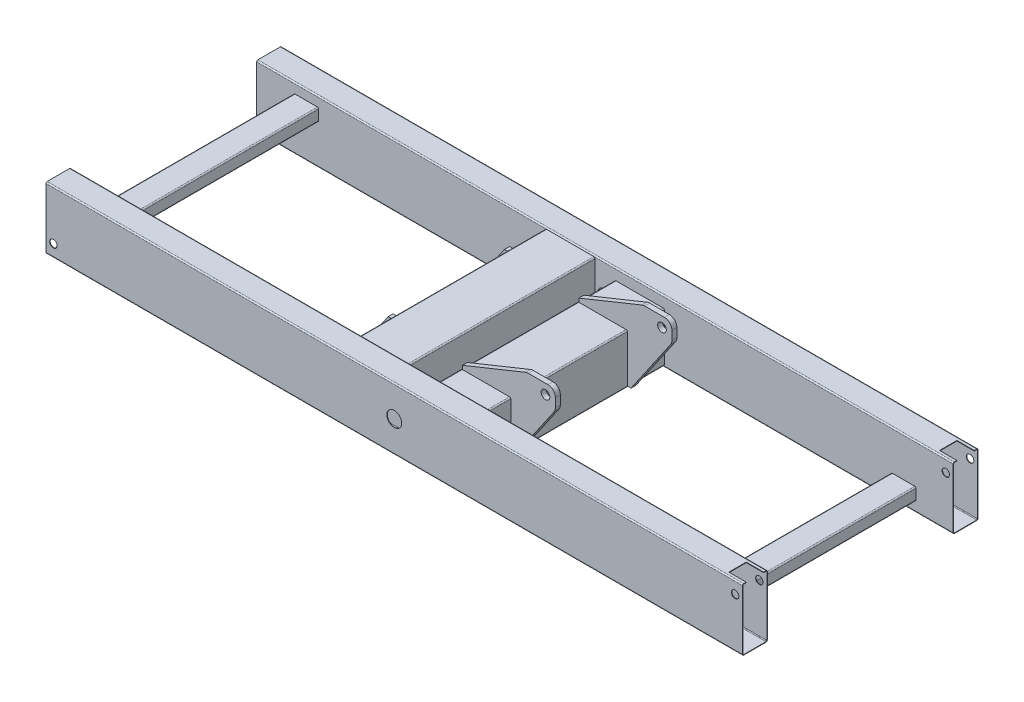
from build123d import *

# Parameters (mm, degrees)
C_250X100X2_1_DEPTH   = 2810
C_250X100X2_1_2_DEPTH = 2810
BOSS_EXTRUDE1_REACH   = 1648.861
BOSS_EXTRUDE2_REACH   = 1648.861
SKETCH14_R            = 15
SKETCH14_R_2          = 30
CUT_EXTRUDE1_DEPTH    = 1701.632235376
SKETCH15_W            = 70
SKETCH15_H            = 70
CUT_EXTRUDE2_DEPTH    = 10
SKETCH16_R            = 17.5
BOSS_EXTRUDE3_DEPTH   = 245
BOSS_EXTRUDE3_2_DEPTH = 245
SKETCH16_2_R          = 17.5
CUT_EXTRUDE3_DEPTH    = 225


with BuildPart() as part:
    # Sketch11 → C 250X100X2_1 (new body)
    with BuildSketch(Plane(origin=(-1405, 0, -425), x_dir=(0, 1, 0), z_dir=(1, 0, 0))):
        with BuildLine():
            Line((-120, 50), (120, 50))
            ThreePointArc((120, 50), (123.535533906, 48.535533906), (125, 45))
            Line((125, 45), (125, -45))
            ThreePointArc((125, -45), (123.535533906, -48.535533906), (120, -50))
            Line((120, -50), (-120, -50))
            ThreePointArc((-120, -50), (-123.535533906, -48.535533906), (-125, -45))
            Line((-125, -45), (-125, 45))
            ThreePointArc((-125, 45), (-123.535533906, 48.535533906), (-120, 50))
        make_face()
        with BuildLine():
            Line((-123, 45), (-123, -45))
            ThreePointArc((-123, -45), (-122.121320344, -47.121320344), (-120, -48))
            Line((-120, -48), (120, -48))
            ThreePointArc((120, -48), (122.121320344, -47.121320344), (123, -45))
            Line((123, -45), (123, 45))
            ThreePointArc((123, 45), (122.121320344, 47.121320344), (120, 48))
            Line((120, 48), (-120, 48))
            ThreePointArc((-120, 48), (-122.121320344, 47.121320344), (-123, 45))
        make_face(mode=Mode.SUBTRACT)
    extrude(amount=C_250X100X2_1_DEPTH)


with BuildPart() as body_2:
    # Sketch11 on segment 2 (on carried to segment 2) → C 250X100X2_1 2 (new body)
    with BuildSketch(Plane(origin=(-1405, 0, 425), x_dir=(0, 1, 0), z_dir=(1, 0, 0))):
        with BuildLine():
            Line((-120, 50), (120, 50))
            ThreePointArc((120, 50), (123.535533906, 48.535533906), (125, 45))
            Line((125, 45), (125, -45))
            ThreePointArc((125, -45), (123.535533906, -48.535533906), (120, -50))
            Line((120, -50), (-120, -50))
            ThreePointArc((-120, -50), (-123.535533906, -48.535533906), (-125, -45))
            Line((-125, -45), (-125, 45))
            ThreePointArc((-125, 45), (-123.535533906, 48.535533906), (-120, 50))
        make_face()
        with BuildLine():
            Line((-123, 45), (-123, -45))
            ThreePointArc((-123, -45), (-122.121320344, -47.121320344), (-120, -48))
            Line((-120, -48), (120, -48))
            ThreePointArc((120, -48), (122.121320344, -47.121320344), (123, -45))
            Line((123, -45), (123, 45))
            ThreePointArc((123, 45), (122.121320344, 47.121320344), (120, 48))
            Line((120, 48), (-120, 48))
            ThreePointArc((-120, 48), (-122.121320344, 47.121320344), (-123, 45))
        make_face(mode=Mode.SUBTRACT)
    extrude(amount=C_250X100X2_1_2_DEPTH)


with BuildPart() as body_3:

    # Sketch12 → Boss-Extrude1 (new, up to next)
    with BuildSketch(Plane.XY.offset(-375), mode=Mode.PRIVATE) as boss_extrude1_sk1:
        with BuildLine():
            Line((1160, -35), (1250, -35))
            ThreePointArc((1250, -35), (1253.535533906, -36.464466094), (1255, -40))
            Line((1255, -40), (1255, -80))
            ThreePointArc((1255, -80), (1253.535533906, -83.535533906), (1250, -85))
            Line((1250, -85), (1160, -85))
            ThreePointArc((1160, -85), (1156.464466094, -83.535533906), (1155, -80))
            Line((1155, -80), (1155, -40))
            ThreePointArc((1155, -40), (1156.464466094, -36.464466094), (1160, -35))
        make_face()
        with BuildLine():
            Line((1157, -40), (1157, -80))
            ThreePointArc((1157, -80), (1157.878679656, -82.121320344), (1160, -83))
            Line((1160, -83), (1250, -83))
            ThreePointArc((1250, -83), (1252.121320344, -82.121320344), (1253, -80))
            Line((1253, -80), (1253, -40))
            ThreePointArc((1253, -40), (1252.121320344, -37.878679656), (1250, -37))
            Line((1250, -37), (1160, -37))
            ThreePointArc((1160, -37), (1157.878679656, -37.878679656), (1157, -40))
        make_face(mode=Mode.SUBTRACT)
    boss_extrude1_tool1 = extrude(boss_extrude1_sk1.sketch, amount=BOSS_EXTRUDE1_REACH, mode=Mode.PRIVATE) - body_2.part
    # Sketch12 → Boss-Extrude1 (new, up to next)
    with BuildSketch(Plane.XY.offset(-375), mode=Mode.PRIVATE) as boss_extrude1_sk2:
        with BuildLine():
            Line((-1160, 35), (-1250, 35))
            ThreePointArc((-1250, 35), (-1253.535533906, 36.464466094), (-1255, 40))
            Line((-1255, 40), (-1255, 80))
            ThreePointArc((-1255, 80), (-1253.535533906, 83.535533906), (-1250, 85))
            Line((-1250, 85), (-1160, 85))
            ThreePointArc((-1160, 85), (-1156.464466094, 83.535533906), (-1155, 80))
            Line((-1155, 80), (-1155, 40))
            ThreePointArc((-1155, 40), (-1156.464466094, 36.464466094), (-1160, 35))
        make_face()
        with BuildLine():
            Line((-1157, 40), (-1157, 80))
            ThreePointArc((-1157, 80), (-1157.878679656, 82.121320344), (-1160, 83))
            Line((-1160, 83), (-1250, 83))
            ThreePointArc((-1250, 83), (-1252.121320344, 82.121320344), (-1253, 80))
            Line((-1253, 80), (-1253, 40))
            ThreePointArc((-1253, 40), (-1252.121320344, 37.878679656), (-1250, 37))
            Line((-1250, 37), (-1160, 37))
            ThreePointArc((-1160, 37), (-1157.878679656, 37.878679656), (-1157, 40))
        make_face(mode=Mode.SUBTRACT)
    boss_extrude1_tool2 = extrude(boss_extrude1_sk2.sketch, amount=BOSS_EXTRUDE1_REACH, mode=Mode.PRIVATE) - body_2.part
    add(boss_extrude1_tool1.solids().sort_by_distance((1205, -36.118034, -375))[0])
    add(boss_extrude1_tool2.solids().sort_by_distance((-1205, 36.118034, -375))[0])


with BuildPart() as body_4:

    # Sketch13 → Boss-Extrude2 (new, up to next)
    with BuildSketch(Plane.XY.offset(-375), mode=Mode.PRIVATE) as boss_extrude2_sk1:
        with BuildLine():
            Line((45, 80), (235, 80))
            ThreePointArc((235, 80), (238.535533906, 78.535533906), (240, 75))
            Line((240, 75), (240, -115))
            ThreePointArc((240, -115), (238.535533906, -118.535533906), (235, -120))
            Line((235, -120), (45, -120))
            ThreePointArc((45, -120), (41.464466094, -118.535533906), (40, -115))
            Line((40, -115), (40, 75))
            ThreePointArc((40, 75), (41.464466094, 78.535533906), (45, 80))
        make_face()
        with BuildLine():
            Line((42, 75), (42, -115))
            ThreePointArc((42, -115), (42.878679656, -117.121320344), (45, -118))
            Line((45, -118), (235, -118))
            ThreePointArc((235, -118), (237.121320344, -117.121320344), (238, -115))
            Line((238, -115), (238, 75))
            ThreePointArc((238, 75), (237.121320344, 77.121320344), (235, 78))
            Line((235, 78), (45, 78))
            ThreePointArc((45, 78), (42.878679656, 77.121320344), (42, 75))
        make_face(mode=Mode.SUBTRACT)
    boss_extrude2_tool1 = extrude(boss_extrude2_sk1.sketch, amount=BOSS_EXTRUDE2_REACH, mode=Mode.PRIVATE) - body_2.part
    # Sketch13 → Boss-Extrude2 (new, up to next)
    with BuildSketch(Plane.XY.offset(-375), mode=Mode.PRIVATE) as boss_extrude2_sk2:
        with BuildLine():
            Line((-45, -80), (-235, -80))
            ThreePointArc((-235, -80), (-238.535533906, -78.535533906), (-240, -75))
            Line((-240, -75), (-240, 115))
            ThreePointArc((-240, 115), (-238.535533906, 118.535533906), (-235, 120))
            Line((-235, 120), (-45, 120))
            ThreePointArc((-45, 120), (-41.464466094, 118.535533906), (-40, 115))
            Line((-40, 115), (-40, -75))
            ThreePointArc((-40, -75), (-41.464466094, -78.535533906), (-45, -80))
        make_face()
        with BuildLine():
            Line((-42, -75), (-42, 115))
            ThreePointArc((-42, 115), (-42.878679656, 117.121320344), (-45, 118))
            Line((-45, 118), (-235, 118))
            ThreePointArc((-235, 118), (-237.121320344, 117.121320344), (-238, 115))
            Line((-238, 115), (-238, -75))
            ThreePointArc((-238, -75), (-237.121320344, -77.121320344), (-235, -78))
            Line((-235, -78), (-45, -78))
            ThreePointArc((-45, -78), (-42.878679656, -77.121320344), (-42, -75))
        make_face(mode=Mode.SUBTRACT)
    boss_extrude2_tool2 = extrude(boss_extrude2_sk2.sketch, amount=BOSS_EXTRUDE2_REACH, mode=Mode.PRIVATE) - body_2.part
    add(boss_extrude2_tool1.solids().sort_by_distance((140, 79.717157, -375))[0])
    add(boss_extrude2_tool2.solids().sort_by_distance((-40.282843, 20, -375))[0])


with BuildPart() as cut_extrude1_tool:
    # Sketch14 → Cut-Extrude1 (new, through all)
    with BuildSketch(Plane.XY.offset(475)):
        with Locations(Location((1375, 75, 0), (0, 0, 270))):
            Circle(SKETCH14_R)
        with Locations(Location((-1375, -75, 0), (0, 0, 270))):
            Circle(SKETCH14_R)
        with Locations(Location((0, 0, 0), (0, 0, 270))):
            Circle(SKETCH14_R_2)
    extrude(amount=-CUT_EXTRUDE1_DEPTH)


with BuildPart() as part_1:
    add(part.part)

    # Cut-Extrude1: cut by cut_extrude1_tool
    add(cut_extrude1_tool.part, mode=Mode.SUBTRACT)


with BuildPart() as body_2_1:
    add(body_2.part)

    # Cut-Extrude1: cut by cut_extrude1_tool
    add(cut_extrude1_tool.part, mode=Mode.SUBTRACT)


with BuildPart() as cut_extrude2_tool:
    # Sketch15 → Cut-Extrude2 (new body)
    with BuildSketch(Plane(origin=(0, 125, 0), x_dir=(1, 0, 0), z_dir=(0, 1, 0))):
        with Locations((1370, -425)):
            Rectangle(SKETCH15_W, SKETCH15_H)
        with Locations((1370, 425)):
            Rectangle(SKETCH15_W, SKETCH15_H)
    extrude(amount=-CUT_EXTRUDE2_DEPTH)


with BuildPart() as part_2:
    add(part_1.part)

    # Cut-Extrude2: cut by cut_extrude2_tool
    add(cut_extrude2_tool.part, mode=Mode.SUBTRACT)


with BuildPart() as body_2_2:
    add(body_2_1.part)

    # Cut-Extrude2: cut by cut_extrude2_tool
    add(cut_extrude2_tool.part, mode=Mode.SUBTRACT)


with BuildPart() as body_5:
    # Sketch16 → Boss-Extrude3 (new, symmetric)
    with BuildSketch(Plane.XY):
        with BuildLine():
            Line((45, 80), (235, 80))
            ThreePointArc((235, 80), (238.535533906, 78.535533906), (240, 75))
            Line((240, 75), (240, -115))
            Line((240, -115), (255, -115))
            Line((255, -115), (414.721257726, 117.32182942))
            ThreePointArc((414.721257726, 117.32182942), (418.649936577, 125.419315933), (420, 134.317694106))
            Line((420, 134.317694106), (420, 170))
            ThreePointArc((420, 170), (411.213203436, 191.213203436), (390, 200))
            Line((390, 200), (310.828999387, 200))
            ThreePointArc((310.828999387, 200), (305.107009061, 199.449258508), (299.595107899, 197.817255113))
            Line((299.595107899, 197.817255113), (45, 95))
            Line((45, 95), (45, 80))
        make_face()
        with Locations((380, 160)):
            Circle(SKETCH16_R, mode=Mode.SUBTRACT)
    extrude(amount=BOSS_EXTRUDE3_DEPTH, both=True)


with BuildPart() as body_6:
    # Sketch16 → Boss-Extrude3 2 (new, symmetric)
    with BuildSketch(Plane.XY):
        with BuildLine():
            Line((-45, -80), (-235, -80))
            ThreePointArc((-235, -80), (-238.535533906, -78.535533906), (-240, -75))
            Line((-240, -75), (-240, 115))
            Line((-240, 115), (-255, 115))
            Line((-255, 115), (-414.721257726, -117.32182942))
            ThreePointArc((-414.721257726, -117.32182942), (-418.649936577, -125.419315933), (-420, -134.317694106))
            Line((-420, -134.317694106), (-420, -170))
            ThreePointArc((-420, -170), (-411.213203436, -191.213203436), (-390, -200))
            Line((-390, -200), (-310.828999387, -200))
            ThreePointArc((-310.828999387, -200), (-305.107009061, -199.449258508), (-299.595107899, -197.817255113))
            Line((-299.595107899, -197.817255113), (-45, -95))
            Line((-45, -95), (-45, -80))
        make_face()
        with Locations((-380, -160)):
            Circle(SKETCH16_R, mode=Mode.SUBTRACT)
    extrude(amount=BOSS_EXTRUDE3_2_DEPTH, both=True)


with BuildPart() as cut_extrude3_tool:
    # Sketch16_2 → Cut-Extrude3 (new, symmetric)
    # profile 1 of 2: a face of its own
    with BuildSketch(Plane.XY):
        with BuildLine():
            Line((45, 80), (235, 80))
            ThreePointArc((235, 80), (238.535533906, 78.535533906), (240, 75))
            Line((240, 75), (240, -115))
            Line((240, -115), (255, -115))
            Line((255, -115), (414.721257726, 117.32182942))
            ThreePointArc((414.721257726, 117.32182942), (418.649936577, 125.419315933), (420, 134.317694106))
            Line((420, 134.317694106), (420, 170))
            ThreePointArc((420, 170), (411.213203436, 191.213203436), (390, 200))
            Line((390, 200), (310.828999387, 200))
            ThreePointArc((310.828999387, 200), (305.107009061, 199.449258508), (299.595107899, 197.817255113))
            Line((299.595107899, 197.817255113), (45, 95))
            Line((45, 95), (45, 80))
        make_face()
        with Locations((380, 160)):
            Circle(SKETCH16_2_R, mode=Mode.SUBTRACT)
    # profile 2 of 2: a face of its own
    with BuildSketch(Plane.XY):
        with BuildLine():
            Line((-45, -80), (-235, -80))
            ThreePointArc((-235, -80), (-238.535533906, -78.535533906), (-240, -75))
            Line((-240, -75), (-240, 115))
            Line((-240, 115), (-255, 115))
            Line((-255, 115), (-414.721257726, -117.32182942))
            ThreePointArc((-414.721257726, -117.32182942), (-418.649936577, -125.419315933), (-420, -134.317694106))
            Line((-420, -134.317694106), (-420, -170))
            ThreePointArc((-420, -170), (-411.213203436, -191.213203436), (-390, -200))
            Line((-390, -200), (-310.828999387, -200))
            ThreePointArc((-310.828999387, -200), (-305.107009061, -199.449258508), (-299.595107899, -197.817255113))
            Line((-299.595107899, -197.817255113), (-45, -95))
            Line((-45, -95), (-45, -80))
        make_face()
        with Locations((-380, -160)):
            Circle(SKETCH16_2_R, mode=Mode.SUBTRACT)
    extrude(amount=CUT_EXTRUDE3_DEPTH, both=True)


with BuildPart() as body_5_1:
    add(body_5.part)

    # Cut-Extrude3: cut by cut_extrude3_tool
    add(cut_extrude3_tool.part, mode=Mode.SUBTRACT)


with BuildPart() as body_6_1:
    add(body_6.part)

    # Cut-Extrude3: cut by cut_extrude3_tool
    add(cut_extrude3_tool.part, mode=Mode.SUBTRACT)


with BuildPart() as cut_extrude3_piece_1:
    # of the separate pieces the step leaves, piece 1, a body of its own (cut_extrude3_pieces)
    add(body_5_1.part.solids().sort_by_distance((45, 80, -225))[0])


with BuildPart() as cut_extrude3_piece_2:
    # of the separate pieces the step leaves, piece 2, a body of its own (cut_extrude3_pieces)
    add(body_5_1.part.solids().sort_by_distance((45, 80, 245))[0])


with BuildPart() as cut_extrude3_piece_1_of_body_6:
    # of the separate pieces the step leaves, piece 1, a body of its own (cut_extrude3_pieces_of_body_6)
    add(body_6_1.part.solids().sort_by_distance((-45, -80, -225))[0])


with BuildPart() as cut_extrude3_piece_2_of_body_6:
    # of the separate pieces the step leaves, piece 2, a body of its own (cut_extrude3_pieces_of_body_6)
    add(body_6_1.part.solids().sort_by_distance((-45, -80, 245))[0])


solid = Compound([body_3.part, body_4.part, part_2.part, body_2_2.part, cut_extrude3_piece_1.part, cut_extrude3_piece_2.part, cut_extrude3_piece_1_of_body_6.part, cut_extrude3_piece_2_of_body_6.part])
